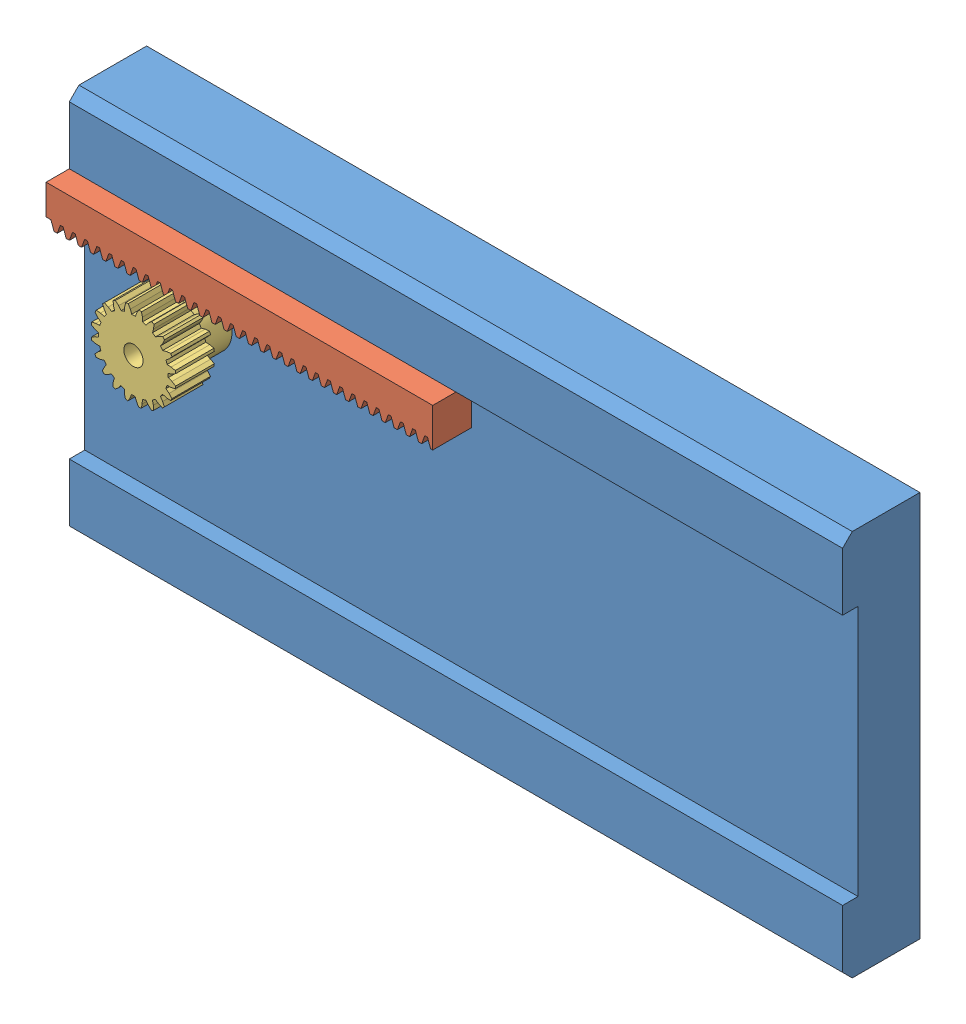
SolidWorks assembly Zahnstange.SLDASM, configuration Standard (file format 4100). Lengths in mm.
Overall size (200 100 34).
3 component instances, 3 part files, 5 mates.
Components (placement in the parent):
- Grundplatte Transferstation-1: Grundplatte Transferstation.SLDPRT [Standard] at (-116.0028 -51.4754 -10) size (200 100 20)
- Zahnstange M1 L100-1: Zahnstange M1 L100.SLDPRT [Standard] at (-116.0028 31.0246 11) x (1 0 0) z (0 0 -1) size (100 10 10)
- Ritzel M1 Z20-3: Ritzel M1 Z20.SLDPRT [Standard] at (-85.4097 11.5246 19) x (0 0 -1) z (0.999995 -0.003019 0) size (18 21.82 21.82)
Mates (geometry in assembly coordinates):
- Deckungsgleich2: coincident anti-aligned: plane of Zahnstange M1 L100-1 through (-116.0028 31.0846 6) normal (0 0 -1); plane of Grundplatte Transferstation-1 through (-116.0028 -33.9754 6) normal (0 0 1)
- Deckungsgleich3: coincident anti-aligned: plane of Zahnstange M1 L100-1 through (133.9972 31.0246 6) normal (0 1 0); plane of Grundplatte Transferstation-1 through (-116.0028 31.0246 6) normal (0 -1 0)
- Deckungsgleich14: coincident anti-aligned: plane of Grundplatte Transferstation-1 through (-116.0028 -33.9754 6) normal (0 0 1); plane of Ritzel M1 Z20-3 through (-77.7971 19.0017 6) normal (0 0 -1)
- Zahnstange/Ritzel-Verknüpfung1: rack pinion = 20 mm: line of Zahnstange M1 L100-1 through (-78.5459 21.0246 16) axis (-1 0 0); circle of Ritzel M1 Z20-3
- Abstand3: distance = 37 mm: plane of Grundplatte Transferstation-1 through (-116.0028 48.5246 10) normal (0 1 0); line of Ritzel M1 Z20-3 through (-85.4097 11.5246 6) axis (0 0 1)
